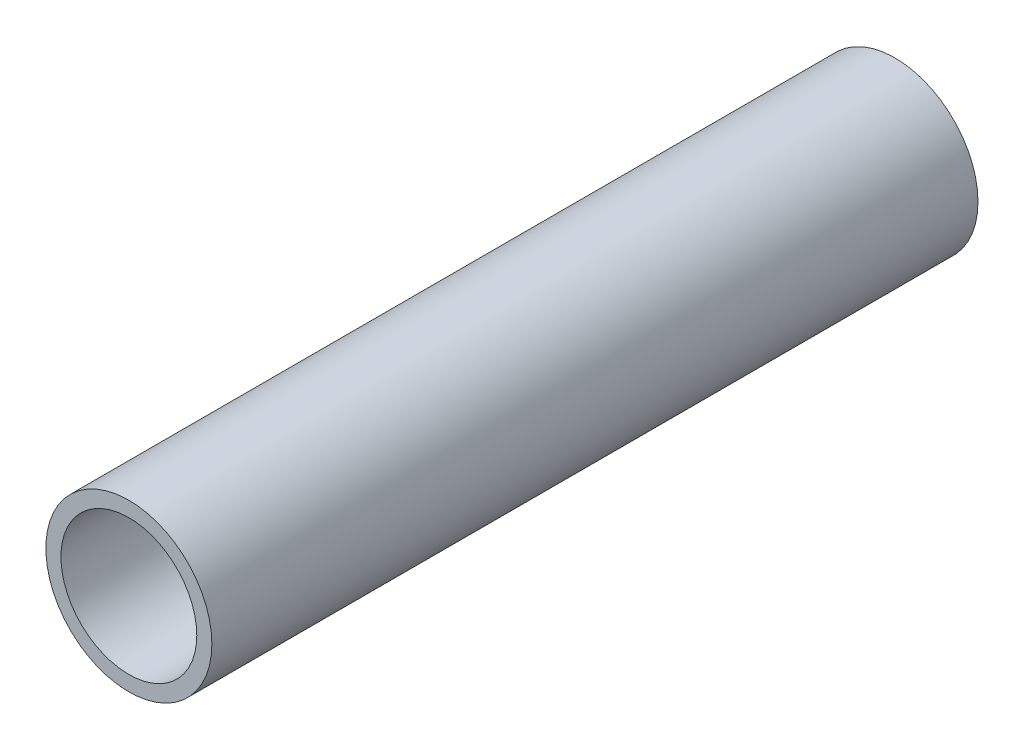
from build123d import *

# Parameters (mm, degrees)
SKETCH1_R           = 8.73125
SKETCH1_R_2         = 7.14375
BOSS_EXTRUDE1_DEPTH = 40.29


with BuildPart() as part:
    # Sketch1 → Boss-Extrude1 (new, symmetric)
    with BuildSketch(Plane.XY):
        Circle(SKETCH1_R)
        Circle(SKETCH1_R_2, mode=Mode.SUBTRACT)
    extrude(amount=BOSS_EXTRUDE1_DEPTH, both=True)


solid = part.part
